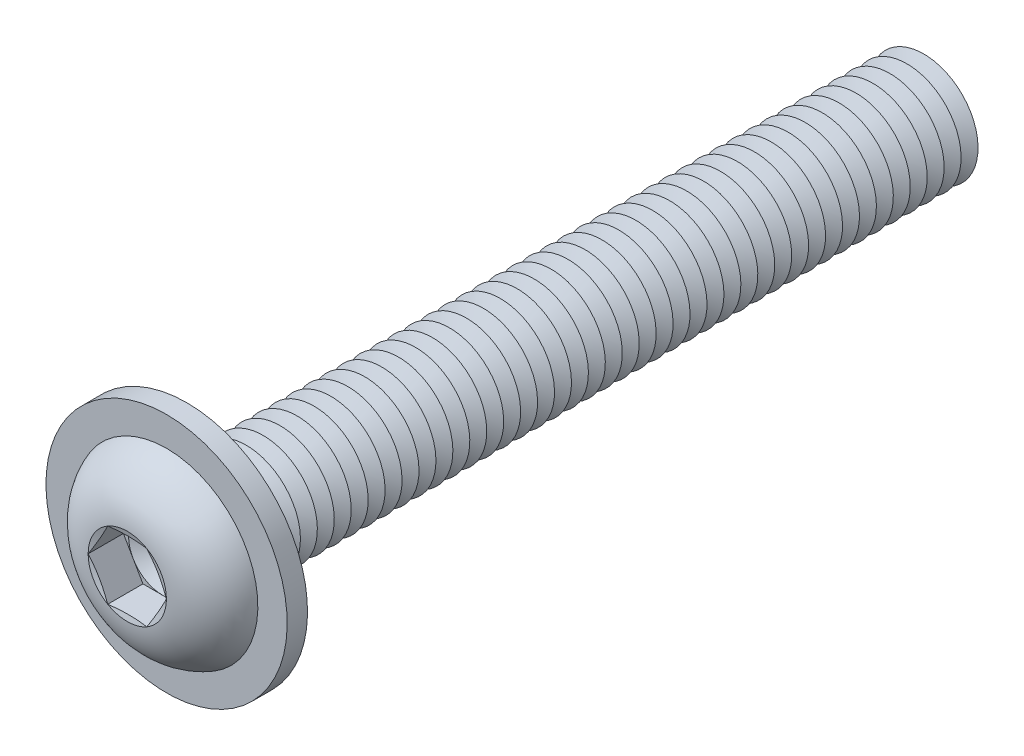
from build123d import *

# Parameters (mm, degrees)
FILLET1_R           = 0.625
LPATTERN1_COUNT     = 44
LPATTERN1_PITCH     = 1.25
CUT_EXTRUDE1_DEPTH  = 2.6
SKETCH5_R           = 8.9
SKETCH5_R_2         = 4.625
BOSS_EXTRUDE1_DEPTH = 1.5


with BuildPart() as part:
    # Sketch1 → Revolve1 (revolve)
    with BuildSketch(Plane(origin=(0, 0, 0), x_dir=(0, 0, -1), z_dir=(1, 0, 0))):
        with BuildLine():
            Line((0, 4), (0, 7))
            ThreePointArc((0, 7), (-3.011595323, 5.81154966), (-4.4, 2.88675))
            Line((-4.4, 2.88675), (-4.013248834, 1.443375))
            Line((-4.013248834, 1.443375), (-4.4, 1.443375))
            Line((-4.4, 1.443375), (-4.4, 0))
            Line((-4.4, 0), (55, 0))
            Line((55, 0), (55, 4))
            Line((55, 4), (0, 4))
        make_face()
    revolve(axis=Axis((0, 0, -55), (0, 0, 1)))

    # Fillet1
    fillet1_edges = [part.edges().sort_by_distance(p)[0] for p in [
        (0, -4, 0),
    ]]
    fillet(fillet1_edges, radius=FILLET1_R)

    # Sketch2 → Cut-Revolve1 (revolve, cut)
    with BuildSketch(Plane(origin=(0, 0, 0), x_dir=(0, 0, -1), z_dir=(1, 0, 0))):
        Polygon((54.375, 4), (55.625, 4), (55, 2.917468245), align=None)
    cut_revolve1 = revolve(axis=Axis((0, 0, -55), (0, 0, -1)), mode=Mode.SUBTRACT)

    # LPattern1: Cut-Revolve1 ×44
    with Locations(*[(0, 0, i * LPATTERN1_PITCH) for i in range(1, LPATTERN1_COUNT)]):
        add(cut_revolve1, mode=Mode.SUBTRACT)

    # Sketch3 → Cut-Extrude1 (cut)
    with BuildSketch(Plane.XY.offset(4.4)):
        Polygon((1.443375, 2.499998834), (-1.443375, 2.499998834), (-2.88675, 0), (-1.443375, -2.499998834), (1.443375, -2.499998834), (2.88675, 0), align=None)
    extrude(amount=-CUT_EXTRUDE1_DEPTH, mode=Mode.SUBTRACT)

    # Cut-Extrude2 cone 1 section (on through the dimple's axis) → Cut-Extrude2 (revolve, cut)
    with BuildSketch(Plane(origin=(0, 0, 1.8), x_dir=(0, -1, 0), z_dir=(1, 0, 0))):
        Polygon((0, 0), (2.499998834, 0), (0, 1.443375), align=None)
    revolve(axis=Axis((0, 0, 1.8), (0, 0, -1)), mode=Mode.SUBTRACT)

    # Sketch5 → Boss-Extrude1 (add)
    with BuildSketch(Plane(origin=(0, 0, 0), x_dir=(-1, 0, 0), z_dir=(0, 0, -1))):
        with Locations(Location((0, 0, 0), (0, 0, 90))):
            Circle(SKETCH5_R)
        Circle(SKETCH5_R_2, mode=Mode.SUBTRACT)
    extrude(amount=-BOSS_EXTRUDE1_DEPTH)


solid = part.part
